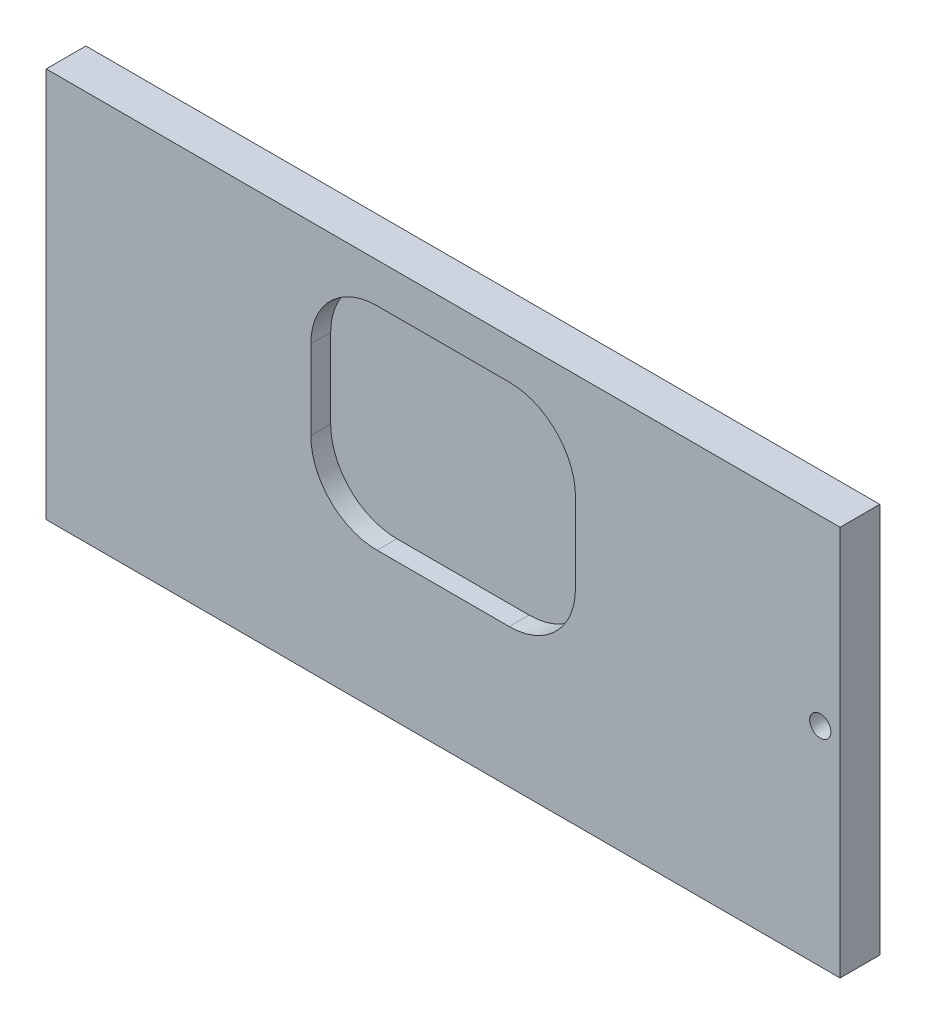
from build123d import *

# Parameters (mm, degrees)
ESQUISSE1_W             = 120
ESQUISSE1_H             = 59
EXTRUSION1_DEPTH        = 6
ESQUISSE2_W             = 40
ESQUISSE2_H             = 32
ENL_V_MAT_EXTRU_1_DEPTH = 3
CONG_1_R                = 10
ESQUISSE3_R             = 1.6
ENL_V_MAT_EXTRU_2_DEPTH = 77.393717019


with BuildPart() as part:
    # Esquisse1 → Extrusion1 (new body)
    with BuildSketch(Plane.XY):
        with Locations((10, 0.5)):
            Rectangle(ESQUISSE1_W, ESQUISSE1_H)
    extrude(amount=EXTRUSION1_DEPTH)

    # Esquisse2 → Enl_v. mat.-Extru.1 (cut)
    with BuildSketch(Plane.XY.offset(6)):
        with Locations((10, 8)):
            Rectangle(ESQUISSE2_W, ESQUISSE2_H)
    extrude(amount=-ENL_V_MAT_EXTRU_1_DEPTH, mode=Mode.SUBTRACT)

    # Cong_1
    cong_1_edges = [part.edges().sort_by_distance(p)[0] for p in [
        (-10, -8, 4.5),
        (-10, 24, 4.5),
        (30, 24, 4.5),
        (30, -8, 4.5),
    ]]
    fillet(cong_1_edges, radius=CONG_1_R)

    # Esquisse3 → Enl_v. mat.-Extru.2 (cut, through all)
    with BuildSketch(Plane.XY.offset(6)):
        with Locations((67, 2.5)):
            Circle(ESQUISSE3_R)
    extrude(amount=-ENL_V_MAT_EXTRU_2_DEPTH, mode=Mode.SUBTRACT)


solid = part.part
